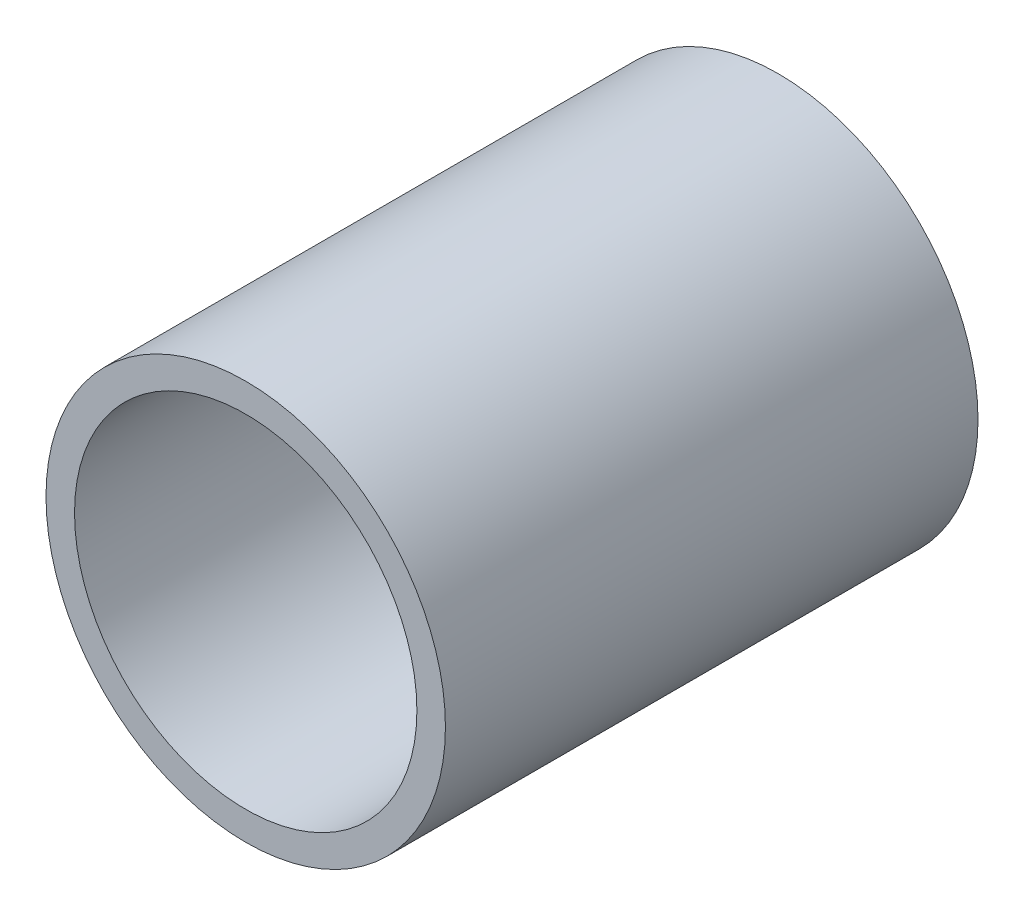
from build123d import *

# Parameters (mm, degrees)
SKETCH_1_R      = 10.5
SKETCH_1_R_2    = 9
EXTRUDE_1_DEPTH = 28


with BuildPart() as part:
    # Sketch 1 → Extrude 1 (new body)
    with BuildSketch(Plane.XY):
        with Locations((-4.5, 0)):
            Circle(SKETCH_1_R)
        with Locations((-4.5, 0)):
            Circle(SKETCH_1_R_2, mode=Mode.SUBTRACT)
    extrude(amount=-EXTRUDE_1_DEPTH)


solid = part.part
